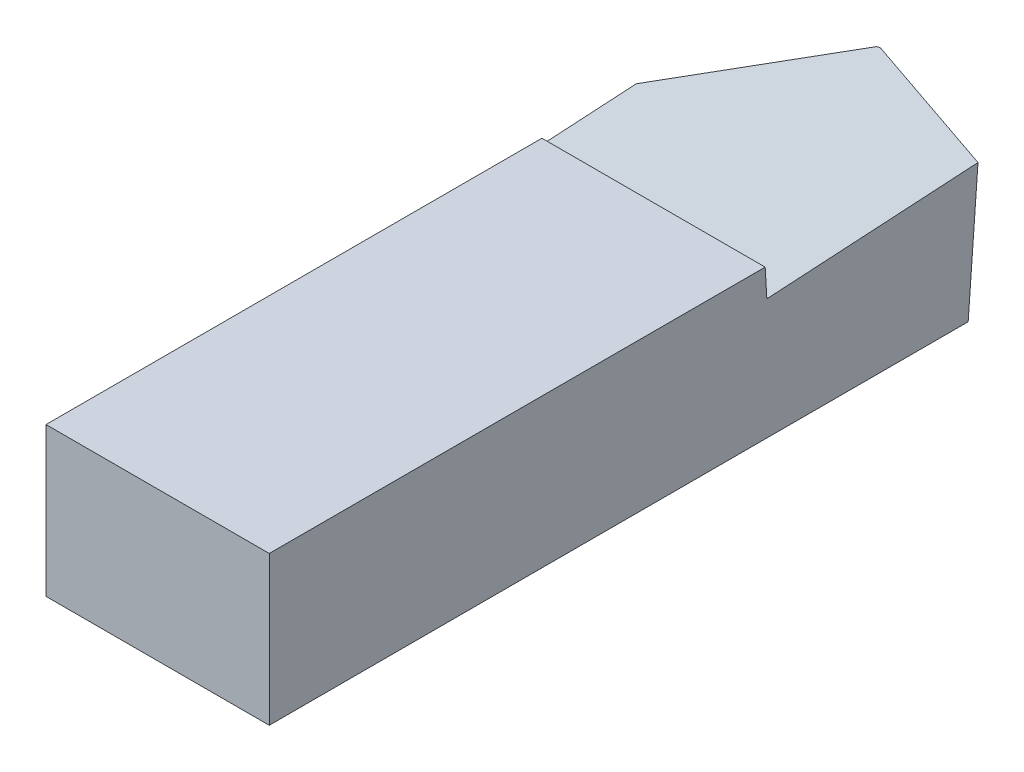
ISO-10303-21;
HEADER;
FILE_DESCRIPTION(('STEP AP214'),'2;1');
FILE_NAME('part.step','',(''),(''),'','','');
FILE_SCHEMA(('AUTOMOTIVE_DESIGN { 1 0 10303 214 1 1 1 1 }'));
ENDSEC;
DATA;
#1=APPLICATION_CONTEXT('core data for automotive mechanical design processes');
#2=APPLICATION_PROTOCOL_DEFINITION('international standard','automotive_design',2000,#1);
#3=PRODUCT_CONTEXT('',#1,'mechanical');
#4=PRODUCT('Part','Part','',(#3));
#5=PRODUCT_RELATED_PRODUCT_CATEGORY('part','',(#4));
#6=PRODUCT_DEFINITION_FORMATION('','',#4);
#7=PRODUCT_DEFINITION_CONTEXT('part definition',#1,'design');
#8=PRODUCT_DEFINITION('design','',#6,#7);
#9=PRODUCT_DEFINITION_SHAPE('','',#8);
#10=(LENGTH_UNIT() NAMED_UNIT(*) SI_UNIT(.MILLI.,.METRE.));
#11=(NAMED_UNIT(*) PLANE_ANGLE_UNIT() SI_UNIT($,.RADIAN.));
#12=(NAMED_UNIT(*) SI_UNIT($,.STERADIAN.) SOLID_ANGLE_UNIT());
#13=UNCERTAINTY_MEASURE_WITH_UNIT(LENGTH_MEASURE(1.E-05),#10,'distance_accuracy_value','');
#14=(GEOMETRIC_REPRESENTATION_CONTEXT(3) GLOBAL_UNCERTAINTY_ASSIGNED_CONTEXT((#13)) GLOBAL_UNIT_ASSIGNED_CONTEXT((#10,
#11,#12)) REPRESENTATION_CONTEXT('',''));
#15=CARTESIAN_POINT('',(0.,0.,0.));
#16=DIRECTION('',(0.,0.,1.));
#17=DIRECTION('',(1.,0.,0.));
#18=AXIS2_PLACEMENT_3D('',#15,#16,#17);
#19=CARTESIAN_POINT('',(-11.9412616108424,0.,100.));
#20=DIRECTION('',(0.,-1.,0.));
#21=DIRECTION('',(0.,0.,-1.));
#22=AXIS2_PLACEMENT_3D('',#19,#20,#21);
#23=PLANE('',#22);
#24=DIRECTION('',(1.,0.,0.));
#25=VECTOR('',#24,1.);
#26=CARTESIAN_POINT('',(-11.9412616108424,0.,33.3605410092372));
#27=LINE('',#26,#25);
#28=CARTESIAN_POINT('',(-11.9412616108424,0.,33.3605410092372));
#29=VERTEX_POINT('',#28);
#30=CARTESIAN_POINT('',(18.0587383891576,0.,33.3605410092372));
#31=VERTEX_POINT('',#30);
#32=EDGE_CURVE('E120',#29,#31,#27,.T.);
#33=ORIENTED_EDGE('',*,*,#32,.F.);
#34=DIRECTION('',(0.,0.,-1.));
#35=VECTOR('',#34,1.);
#36=CARTESIAN_POINT('',(-11.9412616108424,0.,100.));
#37=LINE('',#36,#35);
#38=CARTESIAN_POINT('',(-11.9412616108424,0.,100.));
#39=VERTEX_POINT('',#38);
#40=EDGE_CURVE('E119',#39,#29,#37,.T.);
#41=ORIENTED_EDGE('',*,*,#40,.F.);
#42=DIRECTION('',(-1.,0.,0.));
#43=VECTOR('',#42,1.);
#44=CARTESIAN_POINT('',(-11.9412616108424,0.,100.));
#45=LINE('',#44,#43);
#46=CARTESIAN_POINT('',(18.0587383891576,0.,100.));
#47=VERTEX_POINT('',#46);
#48=EDGE_CURVE('E142',#47,#39,#45,.T.);
#49=ORIENTED_EDGE('',*,*,#48,.F.);
#50=DIRECTION('',(0.,0.,-1.));
#51=VECTOR('',#50,1.);
#52=CARTESIAN_POINT('',(18.0587383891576,0.,100.));
#53=LINE('',#52,#51);
#54=EDGE_CURVE('E145',#47,#31,#53,.T.);
#55=ORIENTED_EDGE('',*,*,#54,.T.);
#56=EDGE_LOOP('',(#33,#41,#49,#55));
#57=FACE_BOUND('',#56,.T.);
#58=ADVANCED_FACE('F33',(#57),#23,.F.);
#59=CARTESIAN_POINT('',(-11.9412616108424,0.,100.));
#60=DIRECTION('',(1.,0.,0.));
#61=DIRECTION('',(0.,1.,0.));
#62=AXIS2_PLACEMENT_3D('',#59,#60,#61);
#63=PLANE('',#62);
#64=DIRECTION('',(0.,0.998261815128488,0.0589351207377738));
#65=VECTOR('',#64,1.);
#66=CARTESIAN_POINT('',(-11.9412616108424,3.92057800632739,33.5920030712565));
#67=LINE('',#66,#65);
#68=CARTESIAN_POINT('',(-11.9412616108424,-0.745861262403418,33.316507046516));
#69=VERTEX_POINT('',#68);
#70=EDGE_CURVE('E110',#69,#29,#67,.T.);
#71=ORIENTED_EDGE('',*,*,#70,.F.);
#72=DIRECTION('',(0.,0.0589351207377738,-0.998261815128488));
#73=VECTOR('',#72,1.);
#74=CARTESIAN_POINT('',(-11.9412616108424,-4.66643926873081,99.7245039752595));
#75=LINE('',#74,#73);
#76=CARTESIAN_POINT('',(-11.9412616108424,0.,20.6828718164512));
#77=VERTEX_POINT('',#76);
#78=EDGE_CURVE('E95',#69,#77,#75,.T.);
#79=ORIENTED_EDGE('',*,*,#78,.T.);
#80=DIRECTION('',(0.,0.953038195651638,-0.302850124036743));
#81=VECTOR('',#80,1.);
#82=CARTESIAN_POINT('',(-11.9412616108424,-22.8931231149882,27.9576958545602));
#83=LINE('',#82,#81);
#84=CARTESIAN_POINT('',(-11.9412616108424,-20.,27.0383384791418));
#85=VERTEX_POINT('',#84);
#86=EDGE_CURVE('E128',#85,#77,#83,.T.);
#87=ORIENTED_EDGE('',*,*,#86,.F.);
#88=DIRECTION('',(0.,0.,-1.));
#89=VECTOR('',#88,1.);
#90=CARTESIAN_POINT('',(-11.9412616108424,-20.,100.));
#91=LINE('',#90,#89);
#92=CARTESIAN_POINT('',(-11.9412616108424,-20.,100.));
#93=VERTEX_POINT('',#92);
#94=EDGE_CURVE('E151',#93,#85,#91,.T.);
#95=ORIENTED_EDGE('',*,*,#94,.F.);
#96=DIRECTION('',(0.,-1.,0.));
#97=VECTOR('',#96,1.);
#98=CARTESIAN_POINT('',(-11.9412616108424,0.,100.));
#99=LINE('',#98,#97);
#100=EDGE_CURVE('E135',#39,#93,#99,.T.);
#101=ORIENTED_EDGE('',*,*,#100,.F.);
#102=ORIENTED_EDGE('',*,*,#40,.T.);
#103=EDGE_LOOP('',(#71,#79,#87,#95,#101,#102));
#104=FACE_BOUND('',#103,.T.);
#105=ADVANCED_FACE('F116',(#104),#63,.F.);
#106=CARTESIAN_POINT('',(18.0587383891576,0.,100.));
#107=DIRECTION('',(-1.,0.,0.));
#108=DIRECTION('',(0.,-1.,0.));
#109=AXIS2_PLACEMENT_3D('',#106,#107,#108);
#110=PLANE('',#109);
#111=DIRECTION('',(0.,-0.998261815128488,-0.0589351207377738));
#112=VECTOR('',#111,1.);
#113=CARTESIAN_POINT('',(18.0587383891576,3.92057800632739,33.5920030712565));
#114=LINE('',#113,#112);
#115=CARTESIAN_POINT('',(18.0587383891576,-3.80289702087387,33.1360265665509));
#116=VERTEX_POINT('',#115);
#117=EDGE_CURVE('E113',#31,#116,#114,.T.);
#118=ORIENTED_EDGE('',*,*,#117,.F.);
#119=ORIENTED_EDGE('',*,*,#54,.F.);
#120=DIRECTION('',(0.,1.,0.));
#121=VECTOR('',#120,1.);
#122=CARTESIAN_POINT('',(18.0587383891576,0.,100.));
#123=LINE('',#122,#121);
#124=CARTESIAN_POINT('',(18.0587383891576,-20.,100.));
#125=VERTEX_POINT('',#124);
#126=EDGE_CURVE('E140',#125,#47,#123,.T.);
#127=ORIENTED_EDGE('',*,*,#126,.F.);
#128=DIRECTION('',(0.,0.,-1.));
#129=VECTOR('',#128,1.);
#130=CARTESIAN_POINT('',(18.0587383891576,-20.,100.));
#131=LINE('',#130,#129);
#132=CARTESIAN_POINT('',(18.0587383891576,-20.,6.0798615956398));
#133=VERTEX_POINT('',#132);
#134=EDGE_CURVE('E148',#125,#133,#131,.T.);
#135=ORIENTED_EDGE('',*,*,#134,.T.);
#136=DIRECTION('',(0.,-0.997287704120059,0.0736018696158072));
#137=VECTOR('',#136,1.);
#138=CARTESIAN_POINT('',(18.0587383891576,-7.00229320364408,5.12060428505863));
#139=LINE('',#138,#137);
#140=CARTESIAN_POINT('',(18.0587383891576,-2.12769066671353,4.76084866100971));
#141=VERTEX_POINT('',#140);
#142=EDGE_CURVE('E130',#141,#133,#139,.T.);
#143=ORIENTED_EDGE('',*,*,#142,.F.);
#144=DIRECTION('',(0.,-0.0589351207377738,0.998261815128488));
#145=VECTOR('',#144,1.);
#146=CARTESIAN_POINT('',(18.0587383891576,-7.72347502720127,99.5440234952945));
#147=LINE('',#146,#145);
#148=EDGE_CURVE('E105',#141,#116,#147,.T.);
#149=ORIENTED_EDGE('',*,*,#148,.T.);
#150=EDGE_LOOP('',(#118,#119,#127,#135,#143,#149));
#151=FACE_BOUND('',#150,.T.);
#152=ADVANCED_FACE('F168',(#151),#110,.F.);
#153=CARTESIAN_POINT('',(-11.9412616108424,-20.,100.));
#154=DIRECTION('',(0.,1.,0.));
#155=DIRECTION('',(0.,0.,1.));
#156=AXIS2_PLACEMENT_3D('',#153,#154,#155);
#157=PLANE('',#156);
#158=DIRECTION('',(-0.499999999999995,0.,0.866025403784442));
#159=VECTOR('',#158,1.);
#160=CARTESIAN_POINT('',(-43.5345878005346,-20.,81.7595846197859));
#161=LINE('',#160,#159);
#162=CARTESIAN_POINT('',(2.27060914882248,-20.,2.42265625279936));
#163=VERTEX_POINT('',#162);
#164=EDGE_CURVE('E122',#163,#85,#161,.T.);
#165=ORIENTED_EDGE('',*,*,#164,.F.);
#166=CARTESIAN_POINT('',(2.70100475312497,-20.,2.67378743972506));
#167=DIRECTION('',(0.,1.,0.));
#168=DIRECTION('',(-0.759683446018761,0.,-0.650293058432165));
#169=AXIS2_PLACEMENT_3D('',#166,#167,#168);
#170=ELLIPSE('',#169,0.498512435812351,0.49212598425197);
#171=CARTESIAN_POINT('',(2.81795689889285,-20.,2.19443923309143));
#172=VERTEX_POINT('',#171);
#173=EDGE_CURVE('E11',#163,#172,#170,.F.);
#174=ORIENTED_EDGE('',*,*,#173,.T.);
#175=DIRECTION('',(-0.969006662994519,0.,-0.247034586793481));
#176=VECTOR('',#175,1.);
#177=CARTESIAN_POINT('',(12.3719509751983,-20.,4.63009532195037));
#178=LINE('',#177,#176);
#179=EDGE_CURVE('E132',#133,#172,#178,.T.);
#180=ORIENTED_EDGE('',*,*,#179,.F.);
#181=ORIENTED_EDGE('',*,*,#134,.F.);
#182=DIRECTION('',(1.,0.,0.));
#183=VECTOR('',#182,1.);
#184=CARTESIAN_POINT('',(-11.9412616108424,-20.,100.));
#185=LINE('',#184,#183);
#186=EDGE_CURVE('E138',#93,#125,#185,.T.);
#187=ORIENTED_EDGE('',*,*,#186,.F.);
#188=ORIENTED_EDGE('',*,*,#94,.T.);
#189=EDGE_LOOP('',(#165,#174,#180,#181,#187,#188));
#190=FACE_BOUND('',#189,.T.);
#191=ADVANCED_FACE('F173',(#190),#157,.F.);
#192=CARTESIAN_POINT('',(0.,0.,0.));
#193=DIRECTION('',(0.246405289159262,-0.071332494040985,-0.966538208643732));
#194=DIRECTION('',(-0.969006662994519,0.,-0.247034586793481));
#195=AXIS2_PLACEMENT_3D('',#192,#193,#194);
#196=PLANE('',#195);
#197=ORIENTED_EDGE('',*,*,#179,.T.);
#198=DIRECTION('',(-0.121211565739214,0.98718898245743,-0.10375774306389));
#199=VECTOR('',#198,1.);
#200=CARTESIAN_POINT('',(0.355781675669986,0.052807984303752,0.0868041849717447));
#201=LINE('',#200,#199);
#202=CARTESIAN_POINT('',(0.367583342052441,-0.0433088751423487,0.0969064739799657));
#203=VERTEX_POINT('',#202);
#204=EDGE_CURVE('E155',#172,#203,#201,.T.);
#205=ORIENTED_EDGE('',*,*,#204,.T.);
#206=DIRECTION('',(-0.960746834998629,0.113195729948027,-0.253282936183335));
#207=VECTOR('',#206,1.);
#208=CARTESIAN_POINT('',(0.,0.,0.));
#209=LINE('',#208,#207);
#210=EDGE_CURVE('E106',#141,#203,#209,.T.);
#211=ORIENTED_EDGE('',*,*,#210,.F.);
#212=ORIENTED_EDGE('',*,*,#142,.T.);
#213=EDGE_LOOP('',(#197,#205,#211,#212));
#214=FACE_BOUND('',#213,.T.);
#215=ADVANCED_FACE('F161',(#214),#196,.T.);
#216=CARTESIAN_POINT('',(0.,0.,100.));
#217=DIRECTION('',(0.,0.,1.));
#218=DIRECTION('',(1.,0.,0.));
#219=AXIS2_PLACEMENT_3D('',#216,#217,#218);
#220=PLANE('',#219);
#221=ORIENTED_EDGE('',*,*,#100,.T.);
#222=ORIENTED_EDGE('',*,*,#186,.T.);
#223=ORIENTED_EDGE('',*,*,#126,.T.);
#224=ORIENTED_EDGE('',*,*,#48,.T.);
#225=EDGE_LOOP('',(#221,#222,#223,#224));
#226=FACE_BOUND('',#225,.T.);
#227=ADVANCED_FACE('F187',(#226),#220,.T.);
#228=CARTESIAN_POINT('',(0.,0.,0.));
#229=DIRECTION('',(-0.855296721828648,-0.156918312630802,-0.493805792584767));
#230=DIRECTION('',(-0.499999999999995,0.,0.866025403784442));
#231=AXIS2_PLACEMENT_3D('',#228,#229,#230);
#232=PLANE('',#231);
#233=DIRECTION('',(0.499999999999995,0.,-0.866025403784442));
#234=VECTOR('',#233,1.);
#235=CARTESIAN_POINT('',(-46.2865855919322,0.,80.1707179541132));
#236=LINE('',#235,#234);
#237=CARTESIAN_POINT('',(-0.185082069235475,0.,0.320571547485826));
#238=VERTEX_POINT('',#237);
#239=EDGE_CURVE('E100',#77,#238,#236,.T.);
#240=ORIENTED_EDGE('',*,*,#239,.T.);
#241=DIRECTION('',(-0.121211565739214,0.98718898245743,-0.10375774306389));
#242=VECTOR('',#241,1.);
#243=CARTESIAN_POINT('',(-0.186394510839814,0.0106889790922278,0.319448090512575));
#244=LINE('',#243,#242);
#245=EDGE_CURVE('E41',#238,#163,#244,.F.);
#246=ORIENTED_EDGE('',*,*,#245,.T.);
#247=ORIENTED_EDGE('',*,*,#164,.T.);
#248=ORIENTED_EDGE('',*,*,#86,.T.);
#249=EDGE_LOOP('',(#240,#246,#247,#248));
#250=FACE_BOUND('',#249,.T.);
#251=ADVANCED_FACE('F198',(#250),#232,.T.);
#252=CARTESIAN_POINT('',(71.6205364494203,60.9805431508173,36.9606944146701));
#253=DIRECTION('',(0.,0.0589351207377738,-0.998261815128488));
#254=DIRECTION('',(0.,0.998261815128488,0.0589351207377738));
#255=AXIS2_PLACEMENT_3D('',#252,#253,#254);
#256=PLANE('',#255);
#257=ORIENTED_EDGE('',*,*,#70,.T.);
#258=ORIENTED_EDGE('',*,*,#32,.T.);
#259=ORIENTED_EDGE('',*,*,#117,.T.);
#260=DIRECTION('',(0.994830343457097,-0.101374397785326,-0.00598491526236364));
#261=VECTOR('',#260,1.);
#262=CARTESIAN_POINT('',(64.5119726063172,-8.53653695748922,32.8565631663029));
#263=LINE('',#262,#261);
#264=EDGE_CURVE('E98',#69,#116,#263,.T.);
#265=ORIENTED_EDGE('',*,*,#264,.F.);
#266=EDGE_LOOP('',(#257,#258,#259,#265));
#267=FACE_BOUND('',#266,.T.);
#268=ADVANCED_FACE('F109',(#267),#256,.T.);
#269=CARTESIAN_POINT('',(0.,0.,0.));
#270=DIRECTION('',(-0.10155091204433,-0.993101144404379,-0.058630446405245));
#271=DIRECTION('',(0.994812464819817,-0.101725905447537,0.));
#272=AXIS2_PLACEMENT_3D('',#269,#270,#271);
#273=PLANE('',#272);
#274=ORIENTED_EDGE('',*,*,#210,.T.);
#275=CARTESIAN_POINT('',(0.252675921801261,-0.0599618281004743,0.57800497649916));
#276=DIRECTION('',(-0.10155091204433,-0.993101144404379,-0.058630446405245));
#277=DIRECTION('',(-0.801549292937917,0.116586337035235,-0.586452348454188));
#278=AXIS2_PLACEMENT_3D('',#275,#276,#277);
#279=ELLIPSE('',#278,0.511572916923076,0.49212598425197);
#280=EDGE_CURVE('E55',#203,#238,#279,.F.);
#281=ORIENTED_EDGE('',*,*,#280,.T.);
#282=ORIENTED_EDGE('',*,*,#239,.F.);
#283=ORIENTED_EDGE('',*,*,#78,.F.);
#284=ORIENTED_EDGE('',*,*,#264,.T.);
#285=ORIENTED_EDGE('',*,*,#148,.F.);
#286=EDGE_LOOP('',(#274,#281,#282,#283,#284,#285));
#287=FACE_BOUND('',#286,.T.);
#288=ADVANCED_FACE('F97',(#287),#273,.F.);
#289=CARTESIAN_POINT('',(0.234519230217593,0.0879125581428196,0.562462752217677));
#290=DIRECTION('',(-0.121211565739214,0.98718898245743,-0.10375774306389));
#291=DIRECTION('',(-0.992546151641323,-0.121869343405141,0.));
#292=AXIS2_PLACEMENT_3D('',#289,#290,#291);
#293=CYLINDRICAL_SURFACE('',#292,0.49212598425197);
#294=ORIENTED_EDGE('',*,*,#173,.F.);
#295=ORIENTED_EDGE('',*,*,#245,.F.);
#296=ORIENTED_EDGE('',*,*,#280,.F.);
#297=ORIENTED_EDGE('',*,*,#204,.F.);
#298=EDGE_LOOP('',(#294,#295,#296,#297));
#299=FACE_BOUND('',#298,.T.);
#300=ADVANCED_FACE('F35',(#299),#293,.T.);
#301=CLOSED_SHELL('',(#58,#105,#152,#191,#215,#227,#251,#268,#288,#300));
#302=MANIFOLD_SOLID_BREP('B2',#301);
#303=ADVANCED_BREP_SHAPE_REPRESENTATION('',(#18,#302),#14);
#304=SHAPE_DEFINITION_REPRESENTATION(#9,#303);
ENDSEC;
END-ISO-10303-21;
